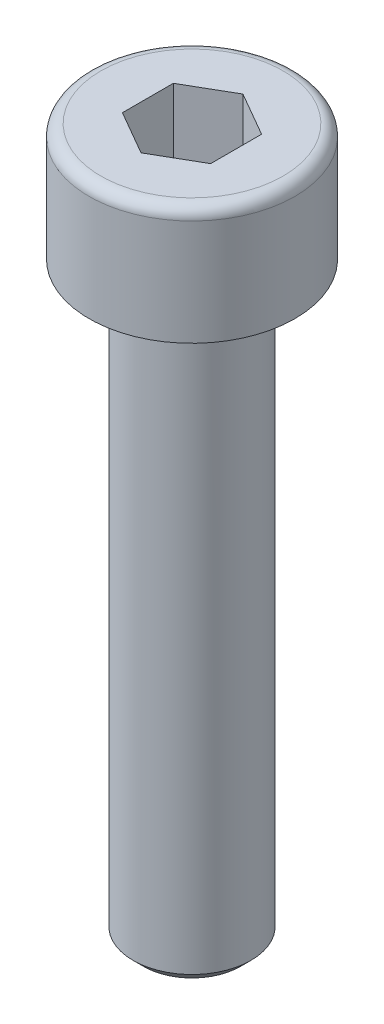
ISO-10303-21;
HEADER;
FILE_DESCRIPTION(('STEP AP214'),'2;1');
FILE_NAME('part.step','',(''),(''),'','','');
FILE_SCHEMA(('AUTOMOTIVE_DESIGN { 1 0 10303 214 1 1 1 1 }'));
ENDSEC;
DATA;
#1=APPLICATION_CONTEXT('core data for automotive mechanical design processes');
#2=APPLICATION_PROTOCOL_DEFINITION('international standard','automotive_design',2000,#1);
#3=PRODUCT_CONTEXT('',#1,'mechanical');
#4=PRODUCT('Part','Part','',(#3));
#5=PRODUCT_RELATED_PRODUCT_CATEGORY('part','',(#4));
#6=PRODUCT_DEFINITION_FORMATION('','',#4);
#7=PRODUCT_DEFINITION_CONTEXT('part definition',#1,'design');
#8=PRODUCT_DEFINITION('design','',#6,#7);
#9=PRODUCT_DEFINITION_SHAPE('','',#8);
#10=(LENGTH_UNIT() NAMED_UNIT(*) SI_UNIT(.MILLI.,.METRE.));
#11=(NAMED_UNIT(*) PLANE_ANGLE_UNIT() SI_UNIT($,.RADIAN.));
#12=(NAMED_UNIT(*) SI_UNIT($,.STERADIAN.) SOLID_ANGLE_UNIT());
#13=UNCERTAINTY_MEASURE_WITH_UNIT(LENGTH_MEASURE(1.E-05),#10,'distance_accuracy_value','');
#14=(GEOMETRIC_REPRESENTATION_CONTEXT(3) GLOBAL_UNCERTAINTY_ASSIGNED_CONTEXT((#13)) GLOBAL_UNIT_ASSIGNED_CONTEXT((#10,
#11,#12)) REPRESENTATION_CONTEXT('',''));
#15=CARTESIAN_POINT('',(0.,0.,0.));
#16=DIRECTION('',(0.,0.,1.));
#17=DIRECTION('',(1.,0.,0.));
#18=AXIS2_PLACEMENT_3D('',#15,#16,#17);
#19=CARTESIAN_POINT('',(1.99999999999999,-24.,0.));
#20=DIRECTION('',(0.,-1.,0.));
#21=DIRECTION('',(1.,0.,0.));
#22=AXIS2_PLACEMENT_3D('',#19,#20,#21);
#23=PLANE('',#22);
#24=CARTESIAN_POINT('',(0.,-24.,0.));
#25=DIRECTION('',(0.,-1.,0.));
#26=DIRECTION('',(1.,0.,0.));
#27=AXIS2_PLACEMENT_3D('',#24,#25,#26);
#28=CIRCLE('',#27,1.64999999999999);
#29=CARTESIAN_POINT('',(1.64999999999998,-24.,0.));
#30=VERTEX_POINT('',#29);
#31=EDGE_CURVE('E11',#30,#30,#28,.T.);
#32=ORIENTED_EDGE('',*,*,#31,.T.);
#33=EDGE_LOOP('',(#32));
#34=FACE_BOUND('',#33,.T.);
#35=ADVANCED_FACE('F30',(#34),#23,.T.);
#36=CARTESIAN_POINT('',(0.,65.1172922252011,0.));
#37=DIRECTION('',(0.,1.,0.));
#38=DIRECTION('',(-1.,0.,0.));
#39=AXIS2_PLACEMENT_3D('',#36,#37,#38);
#40=CYLINDRICAL_SURFACE('',#39,2.);
#41=CARTESIAN_POINT('',(0.,-23.65,0.));
#42=DIRECTION('',(0.,-1.,0.));
#43=DIRECTION('',(1.,0.,0.));
#44=AXIS2_PLACEMENT_3D('',#41,#42,#43);
#45=CIRCLE('',#44,2.);
#46=CARTESIAN_POINT('',(1.99999999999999,-23.65,0.));
#47=VERTEX_POINT('',#46);
#48=EDGE_CURVE('E37',#47,#47,#45,.F.);
#49=ORIENTED_EDGE('',*,*,#48,.T.);
#50=EDGE_LOOP('',(#49));
#51=FACE_BOUND('',#50,.T.);
#52=CARTESIAN_POINT('',(0.,-4.,0.));
#53=DIRECTION('',(0.,1.,0.));
#54=DIRECTION('',(-1.,0.,0.));
#55=AXIS2_PLACEMENT_3D('',#52,#53,#54);
#56=CIRCLE('',#55,2.);
#57=CARTESIAN_POINT('',(-2.00000000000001,-4.,0.));
#58=VERTEX_POINT('',#57);
#59=EDGE_CURVE('E145',#58,#58,#56,.T.);
#60=ORIENTED_EDGE('',*,*,#59,.F.);
#61=EDGE_LOOP('',(#60));
#62=FACE_BOUND('',#61,.T.);
#63=ADVANCED_FACE('F150',(#51,#62),#40,.T.);
#64=CARTESIAN_POINT('',(1.99999999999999,-4.,0.));
#65=DIRECTION('',(0.,1.,0.));
#66=DIRECTION('',(-1.,0.,0.));
#67=AXIS2_PLACEMENT_3D('',#64,#65,#66);
#68=PLANE('',#67);
#69=CARTESIAN_POINT('',(0.,-4.,0.));
#70=DIRECTION('',(0.,1.,0.));
#71=DIRECTION('',(-1.,0.,0.));
#72=AXIS2_PLACEMENT_3D('',#69,#70,#71);
#73=CIRCLE('',#72,3.5);
#74=CARTESIAN_POINT('',(-3.50000000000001,-4.,0.));
#75=VERTEX_POINT('',#74);
#76=EDGE_CURVE('E142',#75,#75,#73,.T.);
#77=ORIENTED_EDGE('',*,*,#76,.F.);
#78=EDGE_LOOP('',(#77));
#79=FACE_BOUND('',#78,.T.);
#80=ORIENTED_EDGE('',*,*,#59,.T.);
#81=EDGE_LOOP('',(#80));
#82=FACE_BOUND('',#81,.T.);
#83=ADVANCED_FACE('F174',(#79,#82),#68,.F.);
#84=CARTESIAN_POINT('',(0.,65.1172922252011,0.));
#85=DIRECTION('',(0.,1.,0.));
#86=DIRECTION('',(-1.,0.,0.));
#87=AXIS2_PLACEMENT_3D('',#84,#85,#86);
#88=CYLINDRICAL_SURFACE('',#87,3.5);
#89=CARTESIAN_POINT('',(0.,-0.399999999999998,0.));
#90=DIRECTION('',(0.,1.,0.));
#91=DIRECTION('',(-1.,0.,0.));
#92=AXIS2_PLACEMENT_3D('',#89,#90,#91);
#93=CIRCLE('',#92,3.5);
#94=CARTESIAN_POINT('',(-3.50000000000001,-0.399999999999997,0.));
#95=VERTEX_POINT('',#94);
#96=EDGE_CURVE('E139',#95,#95,#93,.T.);
#97=ORIENTED_EDGE('',*,*,#96,.F.);
#98=EDGE_LOOP('',(#97));
#99=FACE_BOUND('',#98,.T.);
#100=ORIENTED_EDGE('',*,*,#76,.T.);
#101=EDGE_LOOP('',(#100));
#102=FACE_BOUND('',#101,.T.);
#103=ADVANCED_FACE('F178',(#99,#102),#88,.T.);
#104=CARTESIAN_POINT('',(0.,-0.399999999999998,0.));
#105=DIRECTION('',(0.,1.,0.));
#106=DIRECTION('',(-1.,0.,0.));
#107=AXIS2_PLACEMENT_3D('',#104,#105,#106);
#108=TOROIDAL_SURFACE('',#107,3.1,0.4);
#109=CARTESIAN_POINT('',(0.,0.,0.));
#110=DIRECTION('',(0.,1.,0.));
#111=DIRECTION('',(-1.,0.,0.));
#112=AXIS2_PLACEMENT_3D('',#109,#110,#111);
#113=CIRCLE('',#112,3.1);
#114=CARTESIAN_POINT('',(-3.10000000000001,0.,0.));
#115=VERTEX_POINT('',#114);
#116=EDGE_CURVE('E136',#115,#115,#113,.T.);
#117=ORIENTED_EDGE('',*,*,#116,.F.);
#118=EDGE_LOOP('',(#117));
#119=FACE_BOUND('',#118,.T.);
#120=ORIENTED_EDGE('',*,*,#96,.T.);
#121=EDGE_LOOP('',(#120));
#122=FACE_BOUND('',#121,.T.);
#123=ADVANCED_FACE('F184',(#119,#122),#108,.T.);
#124=CARTESIAN_POINT('',(3.09999999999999,0.,0.));
#125=DIRECTION('',(0.,-1.,0.));
#126=DIRECTION('',(1.,0.,0.));
#127=AXIS2_PLACEMENT_3D('',#124,#125,#126);
#128=PLANE('',#127);
#129=DIRECTION('',(0.,0.,1.));
#130=VECTOR('',#129,1.);
#131=CARTESIAN_POINT('',(-1.5,0.,-0.866025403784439));
#132=LINE('',#131,#130);
#133=CARTESIAN_POINT('',(-1.5,0.,-0.866025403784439));
#134=VERTEX_POINT('',#133);
#135=CARTESIAN_POINT('',(-1.5,0.,0.866025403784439));
#136=VERTEX_POINT('',#135);
#137=EDGE_CURVE('E107',#134,#136,#132,.T.);
#138=ORIENTED_EDGE('',*,*,#137,.F.);
#139=DIRECTION('',(-0.866025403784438,0.,0.5));
#140=VECTOR('',#139,1.);
#141=CARTESIAN_POINT('',(0.,0.,-1.73205080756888));
#142=LINE('',#141,#140);
#143=CARTESIAN_POINT('',(0.,0.,-1.73205080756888));
#144=VERTEX_POINT('',#143);
#145=EDGE_CURVE('E44',#144,#134,#142,.T.);
#146=ORIENTED_EDGE('',*,*,#145,.F.);
#147=DIRECTION('',(0.866025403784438,0.,0.5));
#148=VECTOR('',#147,1.);
#149=CARTESIAN_POINT('',(0.,0.,-1.73205080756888));
#150=LINE('',#149,#148);
#151=CARTESIAN_POINT('',(1.5,0.,-0.866025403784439));
#152=VERTEX_POINT('',#151);
#153=EDGE_CURVE('E352',#144,#152,#150,.T.);
#154=ORIENTED_EDGE('',*,*,#153,.T.);
#155=DIRECTION('',(0.,0.,1.));
#156=VECTOR('',#155,1.);
#157=CARTESIAN_POINT('',(1.5,0.,-0.866025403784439));
#158=LINE('',#157,#156);
#159=CARTESIAN_POINT('',(1.5,0.,0.866025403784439));
#160=VERTEX_POINT('',#159);
#161=EDGE_CURVE('E349',#152,#160,#158,.T.);
#162=ORIENTED_EDGE('',*,*,#161,.T.);
#163=DIRECTION('',(-0.866025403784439,0.,0.5));
#164=VECTOR('',#163,1.);
#165=CARTESIAN_POINT('',(1.5,0.,0.866025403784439));
#166=LINE('',#165,#164);
#167=CARTESIAN_POINT('',(0.,0.,1.73205080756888));
#168=VERTEX_POINT('',#167);
#169=EDGE_CURVE('E346',#160,#168,#166,.T.);
#170=ORIENTED_EDGE('',*,*,#169,.T.);
#171=DIRECTION('',(0.866025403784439,0.,0.5));
#172=VECTOR('',#171,1.);
#173=CARTESIAN_POINT('',(-1.5,0.,0.866025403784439));
#174=LINE('',#173,#172);
#175=EDGE_CURVE('E344',#136,#168,#174,.T.);
#176=ORIENTED_EDGE('',*,*,#175,.F.);
#177=EDGE_LOOP('',(#138,#146,#154,#162,#170,#176));
#178=FACE_BOUND('',#177,.T.);
#179=ORIENTED_EDGE('',*,*,#116,.T.);
#180=EDGE_LOOP('',(#179));
#181=FACE_BOUND('',#180,.T.);
#182=ADVANCED_FACE('F188',(#178,#181),#128,.F.);
#183=CARTESIAN_POINT('',(0.,-2.88,-1.73205080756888));
#184=DIRECTION('',(-0.5,0.,-0.866025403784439));
#185=DIRECTION('',(-0.866025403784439,0.,0.5));
#186=AXIS2_PLACEMENT_3D('',#183,#184,#185);
#187=PLANE('',#186);
#188=DIRECTION('',(0.,1.,0.));
#189=VECTOR('',#188,1.);
#190=CARTESIAN_POINT('',(0.,-2.88,-1.73205080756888));
#191=LINE('',#190,#189);
#192=CARTESIAN_POINT('',(0.,-2.88,-1.73205080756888));
#193=VERTEX_POINT('',#192);
#194=EDGE_CURVE('E134',#193,#144,#191,.T.);
#195=ORIENTED_EDGE('',*,*,#194,.T.);
#196=ORIENTED_EDGE('',*,*,#145,.T.);
#197=DIRECTION('',(0.,1.,0.));
#198=VECTOR('',#197,1.);
#199=CARTESIAN_POINT('',(-1.5,-2.88,-0.866025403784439));
#200=LINE('',#199,#198);
#201=CARTESIAN_POINT('',(-1.5,-2.88,-0.866025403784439));
#202=VERTEX_POINT('',#201);
#203=EDGE_CURVE('E112',#202,#134,#200,.T.);
#204=ORIENTED_EDGE('',*,*,#203,.F.);
#205=DIRECTION('',(-0.866025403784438,0.,0.5));
#206=VECTOR('',#205,1.);
#207=CARTESIAN_POINT('',(0.,-2.88,-1.73205080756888));
#208=LINE('',#207,#206);
#209=EDGE_CURVE('E101',#193,#202,#208,.T.);
#210=ORIENTED_EDGE('',*,*,#209,.F.);
#211=EDGE_LOOP('',(#195,#196,#204,#210));
#212=FACE_BOUND('',#211,.T.);
#213=ADVANCED_FACE('F192',(#212),#187,.F.);
#214=CARTESIAN_POINT('',(0.,-2.88,-1.73205080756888));
#215=DIRECTION('',(-0.5,0.,0.866025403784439));
#216=DIRECTION('',(0.866025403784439,0.,0.5));
#217=AXIS2_PLACEMENT_3D('',#214,#215,#216);
#218=PLANE('',#217);
#219=DIRECTION('',(0.,1.,0.));
#220=VECTOR('',#219,1.);
#221=CARTESIAN_POINT('',(1.5,-2.88,-0.866025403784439));
#222=LINE('',#221,#220);
#223=CARTESIAN_POINT('',(1.5,-2.88,-0.866025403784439));
#224=VERTEX_POINT('',#223);
#225=EDGE_CURVE('E132',#224,#152,#222,.T.);
#226=ORIENTED_EDGE('',*,*,#225,.T.);
#227=ORIENTED_EDGE('',*,*,#153,.F.);
#228=ORIENTED_EDGE('',*,*,#194,.F.);
#229=DIRECTION('',(0.866025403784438,0.,0.5));
#230=VECTOR('',#229,1.);
#231=CARTESIAN_POINT('',(0.,-2.88,-1.73205080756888));
#232=LINE('',#231,#230);
#233=EDGE_CURVE('E125',#193,#224,#232,.T.);
#234=ORIENTED_EDGE('',*,*,#233,.T.);
#235=EDGE_LOOP('',(#226,#227,#228,#234));
#236=FACE_BOUND('',#235,.T.);
#237=ADVANCED_FACE('F194',(#236),#218,.T.);
#238=CARTESIAN_POINT('',(1.5,-2.88,-0.866025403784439));
#239=DIRECTION('',(-1.,0.,0.));
#240=DIRECTION('',(0.,-1.,0.));
#241=AXIS2_PLACEMENT_3D('',#238,#239,#240);
#242=PLANE('',#241);
#243=DIRECTION('',(0.,1.,0.));
#244=VECTOR('',#243,1.);
#245=CARTESIAN_POINT('',(1.5,-2.88,0.866025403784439));
#246=LINE('',#245,#244);
#247=CARTESIAN_POINT('',(1.5,-2.88,0.866025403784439));
#248=VERTEX_POINT('',#247);
#249=EDGE_CURVE('E130',#248,#160,#246,.T.);
#250=ORIENTED_EDGE('',*,*,#249,.T.);
#251=ORIENTED_EDGE('',*,*,#161,.F.);
#252=ORIENTED_EDGE('',*,*,#225,.F.);
#253=DIRECTION('',(0.,0.,1.));
#254=VECTOR('',#253,1.);
#255=CARTESIAN_POINT('',(1.5,-2.88,-0.866025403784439));
#256=LINE('',#255,#254);
#257=EDGE_CURVE('E119',#224,#248,#256,.T.);
#258=ORIENTED_EDGE('',*,*,#257,.T.);
#259=EDGE_LOOP('',(#250,#251,#252,#258));
#260=FACE_BOUND('',#259,.T.);
#261=ADVANCED_FACE('F197',(#260),#242,.T.);
#262=CARTESIAN_POINT('',(1.5,-2.88,0.866025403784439));
#263=DIRECTION('',(-0.5,0.,-0.866025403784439));
#264=DIRECTION('',(-0.866025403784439,0.,0.5));
#265=AXIS2_PLACEMENT_3D('',#262,#263,#264);
#266=PLANE('',#265);
#267=DIRECTION('',(0.,1.,0.));
#268=VECTOR('',#267,1.);
#269=CARTESIAN_POINT('',(0.,-2.88,1.73205080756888));
#270=LINE('',#269,#268);
#271=CARTESIAN_POINT('',(0.,-2.88,1.73205080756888));
#272=VERTEX_POINT('',#271);
#273=EDGE_CURVE('E111',#272,#168,#270,.T.);
#274=ORIENTED_EDGE('',*,*,#273,.T.);
#275=ORIENTED_EDGE('',*,*,#169,.F.);
#276=ORIENTED_EDGE('',*,*,#249,.F.);
#277=DIRECTION('',(-0.866025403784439,0.,0.5));
#278=VECTOR('',#277,1.);
#279=CARTESIAN_POINT('',(1.5,-2.88,0.866025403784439));
#280=LINE('',#279,#278);
#281=EDGE_CURVE('E117',#248,#272,#280,.T.);
#282=ORIENTED_EDGE('',*,*,#281,.T.);
#283=EDGE_LOOP('',(#274,#275,#276,#282));
#284=FACE_BOUND('',#283,.T.);
#285=ADVANCED_FACE('F201',(#284),#266,.T.);
#286=CARTESIAN_POINT('',(-1.5,-2.88,0.866025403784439));
#287=DIRECTION('',(-0.5,0.,0.866025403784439));
#288=DIRECTION('',(0.866025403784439,0.,0.5));
#289=AXIS2_PLACEMENT_3D('',#286,#287,#288);
#290=PLANE('',#289);
#291=DIRECTION('',(0.,1.,0.));
#292=VECTOR('',#291,1.);
#293=CARTESIAN_POINT('',(-1.5,-2.88,0.866025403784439));
#294=LINE('',#293,#292);
#295=CARTESIAN_POINT('',(-1.5,-2.88,0.866025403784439));
#296=VERTEX_POINT('',#295);
#297=EDGE_CURVE('E104',#296,#136,#294,.T.);
#298=ORIENTED_EDGE('',*,*,#297,.T.);
#299=ORIENTED_EDGE('',*,*,#175,.T.);
#300=ORIENTED_EDGE('',*,*,#273,.F.);
#301=DIRECTION('',(0.866025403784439,0.,0.5));
#302=VECTOR('',#301,1.);
#303=CARTESIAN_POINT('',(-1.5,-2.88,0.866025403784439));
#304=LINE('',#303,#302);
#305=EDGE_CURVE('E52',#296,#272,#304,.T.);
#306=ORIENTED_EDGE('',*,*,#305,.F.);
#307=EDGE_LOOP('',(#298,#299,#300,#306));
#308=FACE_BOUND('',#307,.T.);
#309=ADVANCED_FACE('F115',(#308),#290,.F.);
#310=CARTESIAN_POINT('',(-1.5,-2.88,-0.866025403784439));
#311=DIRECTION('',(-1.,0.,0.));
#312=DIRECTION('',(0.,-1.,0.));
#313=AXIS2_PLACEMENT_3D('',#310,#311,#312);
#314=PLANE('',#313);
#315=DIRECTION('',(0.,0.,1.));
#316=VECTOR('',#315,1.);
#317=CARTESIAN_POINT('',(-1.5,-2.88,-0.866025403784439));
#318=LINE('',#317,#316);
#319=EDGE_CURVE('E94',#202,#296,#318,.T.);
#320=ORIENTED_EDGE('',*,*,#319,.F.);
#321=ORIENTED_EDGE('',*,*,#203,.T.);
#322=ORIENTED_EDGE('',*,*,#137,.T.);
#323=ORIENTED_EDGE('',*,*,#297,.F.);
#324=EDGE_LOOP('',(#320,#321,#322,#323));
#325=FACE_BOUND('',#324,.T.);
#326=ADVANCED_FACE('F105',(#325),#314,.F.);
#327=CARTESIAN_POINT('',(-1.5,-2.88,-0.866025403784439));
#328=DIRECTION('',(0.104319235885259,0.977992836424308,0.180686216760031));
#329=DIRECTION('',(0.,-0.181677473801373,0.983358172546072));
#330=AXIS2_PLACEMENT_3D('',#327,#328,#329);
#331=PLANE('',#330);
#332=DIRECTION('',(-0.85161315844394,0.181677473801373,-0.491679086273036));
#333=VECTOR('',#332,1.);
#334=CARTESIAN_POINT('',(0.,-3.2,0.));
#335=LINE('',#334,#333);
#336=CARTESIAN_POINT('',(0.,-3.2,0.));
#337=VERTEX_POINT('',#336);
#338=EDGE_CURVE('E98',#337,#202,#335,.T.);
#339=ORIENTED_EDGE('',*,*,#338,.F.);
#340=DIRECTION('',(0.,0.181677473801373,-0.983358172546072));
#341=VECTOR('',#340,1.);
#342=CARTESIAN_POINT('',(0.,-3.2,0.));
#343=LINE('',#342,#341);
#344=EDGE_CURVE('E337',#337,#193,#343,.T.);
#345=ORIENTED_EDGE('',*,*,#344,.T.);
#346=ORIENTED_EDGE('',*,*,#209,.T.);
#347=EDGE_LOOP('',(#339,#345,#346));
#348=FACE_BOUND('',#347,.T.);
#349=ADVANCED_FACE('F158',(#348),#331,.T.);
#350=CARTESIAN_POINT('',(0.,-2.88,-1.73205080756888));
#351=DIRECTION('',(-0.104319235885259,0.977992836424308,0.180686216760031));
#352=DIRECTION('',(0.,-0.181677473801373,0.983358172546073));
#353=AXIS2_PLACEMENT_3D('',#350,#351,#352);
#354=PLANE('',#353);
#355=ORIENTED_EDGE('',*,*,#344,.F.);
#356=DIRECTION('',(0.85161315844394,0.181677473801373,-0.491679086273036));
#357=VECTOR('',#356,1.);
#358=CARTESIAN_POINT('',(0.,-3.2,0.));
#359=LINE('',#358,#357);
#360=EDGE_CURVE('E90',#337,#224,#359,.T.);
#361=ORIENTED_EDGE('',*,*,#360,.T.);
#362=ORIENTED_EDGE('',*,*,#233,.F.);
#363=EDGE_LOOP('',(#355,#361,#362));
#364=FACE_BOUND('',#363,.T.);
#365=ADVANCED_FACE('F166',(#364),#354,.T.);
#366=CARTESIAN_POINT('',(-1.5,-2.88,0.866025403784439));
#367=DIRECTION('',(0.208638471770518,0.977992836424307,0.));
#368=DIRECTION('',(-0.977992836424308,0.208638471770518,0.));
#369=AXIS2_PLACEMENT_3D('',#366,#367,#368);
#370=PLANE('',#369);
#371=DIRECTION('',(-0.85161315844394,0.181677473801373,0.491679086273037));
#372=VECTOR('',#371,1.);
#373=CARTESIAN_POINT('',(0.,-3.2,0.));
#374=LINE('',#373,#372);
#375=EDGE_CURVE('E84',#337,#296,#374,.T.);
#376=ORIENTED_EDGE('',*,*,#375,.F.);
#377=ORIENTED_EDGE('',*,*,#338,.T.);
#378=ORIENTED_EDGE('',*,*,#319,.T.);
#379=EDGE_LOOP('',(#376,#377,#378));
#380=FACE_BOUND('',#379,.T.);
#381=ADVANCED_FACE('F96',(#380),#370,.T.);
#382=CARTESIAN_POINT('',(1.5,-2.88,-0.866025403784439));
#383=DIRECTION('',(-0.208638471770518,0.977992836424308,0.));
#384=DIRECTION('',(-0.977992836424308,-0.208638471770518,0.));
#385=AXIS2_PLACEMENT_3D('',#382,#383,#384);
#386=PLANE('',#385);
#387=ORIENTED_EDGE('',*,*,#360,.F.);
#388=DIRECTION('',(0.85161315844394,0.181677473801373,0.491679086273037));
#389=VECTOR('',#388,1.);
#390=CARTESIAN_POINT('',(0.,-3.2,0.));
#391=LINE('',#390,#389);
#392=EDGE_CURVE('E91',#337,#248,#391,.T.);
#393=ORIENTED_EDGE('',*,*,#392,.T.);
#394=ORIENTED_EDGE('',*,*,#257,.F.);
#395=EDGE_LOOP('',(#387,#393,#394));
#396=FACE_BOUND('',#395,.T.);
#397=ADVANCED_FACE('F217',(#396),#386,.T.);
#398=CARTESIAN_POINT('',(0.,-2.88,1.73205080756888));
#399=DIRECTION('',(0.104319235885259,0.977992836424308,-0.180686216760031));
#400=DIRECTION('',(0.,0.181677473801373,0.983358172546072));
#401=AXIS2_PLACEMENT_3D('',#398,#399,#400);
#402=PLANE('',#401);
#403=DIRECTION('',(0.,0.181677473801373,0.983358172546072));
#404=VECTOR('',#403,1.);
#405=CARTESIAN_POINT('',(0.,-3.2,0.));
#406=LINE('',#405,#404);
#407=EDGE_CURVE('E87',#337,#272,#406,.T.);
#408=ORIENTED_EDGE('',*,*,#407,.F.);
#409=ORIENTED_EDGE('',*,*,#375,.T.);
#410=ORIENTED_EDGE('',*,*,#305,.T.);
#411=EDGE_LOOP('',(#408,#409,#410));
#412=FACE_BOUND('',#411,.T.);
#413=ADVANCED_FACE('F86',(#412),#402,.T.);
#414=CARTESIAN_POINT('',(1.5,-2.88,0.866025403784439));
#415=DIRECTION('',(-0.104319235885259,0.977992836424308,-0.180686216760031));
#416=DIRECTION('',(0.,0.181677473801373,0.983358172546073));
#417=AXIS2_PLACEMENT_3D('',#414,#415,#416);
#418=PLANE('',#417);
#419=ORIENTED_EDGE('',*,*,#392,.F.);
#420=ORIENTED_EDGE('',*,*,#407,.T.);
#421=ORIENTED_EDGE('',*,*,#281,.F.);
#422=EDGE_LOOP('',(#419,#420,#421));
#423=FACE_BOUND('',#422,.T.);
#424=ADVANCED_FACE('F155',(#423),#418,.T.);
#425=CARTESIAN_POINT('',(0.,-23.65,0.));
#426=DIRECTION('',(0.,1.,0.));
#427=DIRECTION('',(-1.,0.,0.));
#428=AXIS2_PLACEMENT_3D('',#425,#426,#427);
#429=CONICAL_SURFACE('',#428,2.,0.785398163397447);
#430=ORIENTED_EDGE('',*,*,#31,.F.);
#431=EDGE_LOOP('',(#430));
#432=FACE_BOUND('',#431,.T.);
#433=ORIENTED_EDGE('',*,*,#48,.F.);
#434=EDGE_LOOP('',(#433));
#435=FACE_BOUND('',#434,.T.);
#436=ADVANCED_FACE('F153',(#432,#435),#429,.T.);
#437=CLOSED_SHELL('',(#35,#63,#83,#103,#123,#182,#213,#237,#261,#285,#309,#326,#349,#365,#381,
#397,#413,#424,#436));
#438=MANIFOLD_SOLID_BREP('B2',#437);
#439=ADVANCED_BREP_SHAPE_REPRESENTATION('',(#18,#438),#14);
#440=SHAPE_DEFINITION_REPRESENTATION(#9,#439);
ENDSEC;
END-ISO-10303-21;
